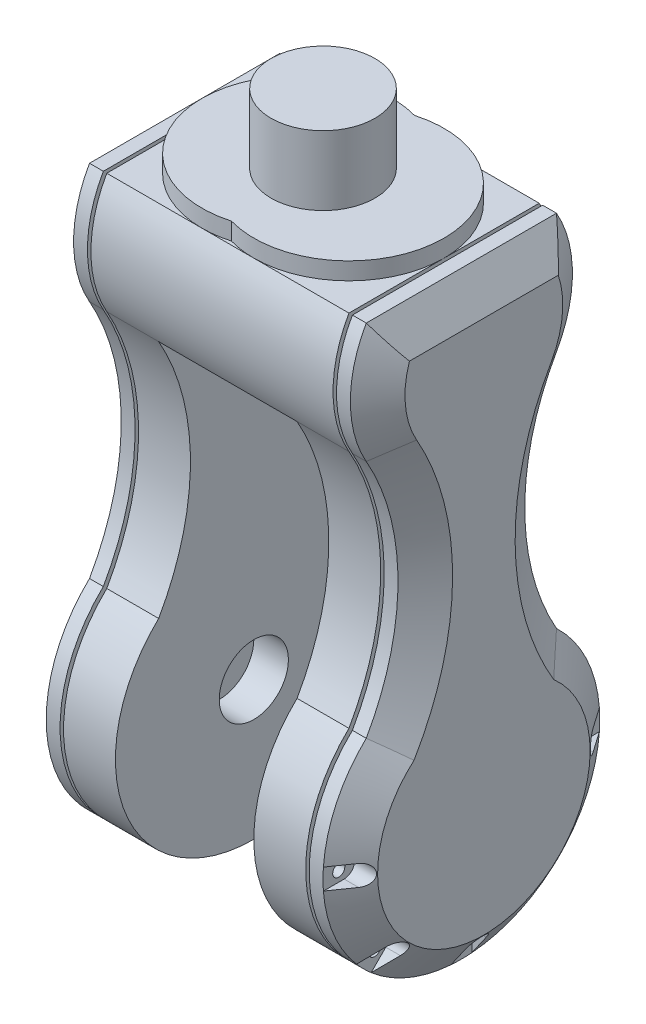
from build123d import *

# Parameters (mm, degrees)
SKETCH1_R                       = 27.5
BOSS_EXTRUDE1_DEPTH             = 5
BOSS_EXTRUDE2_DEPTH             = 15
BOSS_EXTRUDE4_DEPTH             = 1
BOSS_EXTRUDE6_DEPTH             = 4
BOSS_EXTRUDE7_DEPTH             = 6.5
BOSS_EXTRUDE7_DRAFT             = 55
CUT_EXTRUDE1_DEPTH              = 6.5
SKETCH14_R                      = 1.75
CUT_EXTRUDE2_DEPTH              = 5
CIRPATTERN2_COUNT               = 3
CIRPATTERN2_ANGLE               = 90
CIRPATTERN2_THE_OTHER_WAY_COUNT = 3
CIRPATTERN2_THE_OTHER_WAY_ANGLE = 90
BOSS_EXTRUDE8_DEPTH             = 40
SKETCH19_R                      = 15
BOSS_EXTRUDE9_DEPTH             = 20
SKETCH21_R                      = 10
CUT_EXTRUDE3_DEPTH              = 10


with BuildPart() as part:
    # Sketch1 → Boss-Extrude1 (new body)
    with BuildSketch(Plane(origin=(0, 0, 0), x_dir=(1, 0, 0), z_dir=(0, 1, 0))):
        with Locations(Location((0, 0, 0), (0, 0, 270))):
            Circle(SKETCH1_R)
    extrude(amount=BOSS_EXTRUDE1_DEPTH)



with BuildPart() as body_2:
    # Sketch5 → Boss-Extrude2 (new body)
    with BuildSketch(Plane(origin=(27.5, 0, 0), x_dir=(0, 0, -1), z_dir=(1, 0, 0))):
        with BuildLine():
            Line((-27.5, 0), (27.5, 0))
            ThreePointArc((27.5, 0), (32.08899515, -17.325437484), (27.5, -34.650874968))
            ThreePointArc((27.5, -34.650874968), (18.3220097, -69.301749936), (27.5, -103.952624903))
            ThreePointArc((27.5, -103.952624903), (0, -173), (-27.5, -103.952624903))
            ThreePointArc((-27.5, -103.952624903), (-18.3220097, -69.301749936), (-27.5, -34.650874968))
            ThreePointArc((-27.5, -34.650874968), (-32.08899515, -17.325437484), (-27.5, 0))
        make_face()
    extrude(amount=BOSS_EXTRUDE2_DEPTH)

    # Sketch10 → Boss-Extrude4 (add)
    with BuildSketch(Plane(origin=(42.5, 0, 0), x_dir=(0, 0, -1), z_dir=(1, 0, 0))):
        with BuildLine():
            Line((26.010551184, -2.5), (-26.010551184, -2.5))
            ThreePointArc((-26.010551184, -2.5), (-29.58107112, -18.04307188), (-25.327785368, -33.413343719))
            ThreePointArc((-25.327785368, -33.413343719), (-15.822259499, -69.492067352), (-25.517071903, -105.520388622))
            ThreePointArc((-25.517071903, -105.520388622), (0, -170.5), (25.517071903, -105.520388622))
            ThreePointArc((25.517071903, -105.520388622), (15.822259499, -69.492067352), (25.327785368, -33.413343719))
            ThreePointArc((25.327785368, -33.413343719), (29.58107112, -18.04307188), (26.010551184, -2.5))
        make_face()
    extrude(amount=BOSS_EXTRUDE4_DEPTH)

    # Sketch11 → Boss-Extrude6 (add)
    with BuildSketch(Plane(origin=(43.5, 0, 0), x_dir=(0, 0, -1), z_dir=(1, 0, 0))):
        with BuildLine():
            Line((27.5, 0), (-27.5, 0))
            ThreePointArc((-27.5, 0), (-32.08899515, -17.325437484), (-27.5, -34.650874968))
            ThreePointArc((-27.5, -34.650874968), (-18.3220097, -69.301749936), (-27.5, -103.952624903))
            ThreePointArc((-27.5, -103.952624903), (0, -173), (27.5, -103.952624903))
            ThreePointArc((27.5, -103.952624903), (18.3220097, -69.301749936), (27.5, -34.650874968))
            ThreePointArc((27.5, -34.650874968), (32.08899515, -17.325437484), (27.5, 0))
        make_face()
    extrude(amount=BOSS_EXTRUDE6_DEPTH)


with BuildPart() as boss_extrude7_tool:
    # Sketch12 → Boss-Extrude7 (with draft: the straight prism first)
    with BuildSketch(Plane(origin=(47.5, 0, 0), x_dir=(0, 0, -1), z_dir=(1, 0, 0))):
        with BuildLine():
            Line((27.5, 0), (-27.5, 0))
            ThreePointArc((-27.5, 0), (-32.08899515, -17.325437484), (-27.5, -34.650874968))
            ThreePointArc((-27.5, -34.650874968), (-18.3220097, -69.301749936), (-27.5, -103.952624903))
            ThreePointArc((-27.5, -103.952624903), (0, -173), (27.5, -103.952624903))
            ThreePointArc((27.5, -103.952624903), (18.3220097, -69.301749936), (27.5, -34.650874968))
            ThreePointArc((27.5, -34.650874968), (32.08899515, -17.325437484), (27.5, 0))
        make_face()
    extrude(amount=BOSS_EXTRUDE7_DEPTH)
    # Boss-Extrude7: the draft: its side faces are tilted about the plane it starts from
    boss_extrude7_sides = [boss_extrude7_tool.faces().sort_by_distance(p)[0] for p in [
        (50.75, -17.325437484, -32.08899515),
        (50.75, 0, 0),
        (50.75, -17.325437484, 32.08899515),
        (50.75, -69.301749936, 18.3220097),
        (50.75, -173, 0),
        (50.75, -69.301749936, -18.3220097),
    ]]
    draft(boss_extrude7_sides, Plane(origin=(47.5, 0, 0), x_dir=(0, 0, -1), z_dir=(1, 0, 0)), BOSS_EXTRUDE7_DRAFT)


with BuildPart() as body_2_1:
    add(body_2.part)

    # Boss-Extrude7: add boss_extrude7_tool
    add(boss_extrude7_tool.part)

    # Sketch13 → Cut-Extrude1 (cut)
    with BuildSketch(Plane(origin=(54, 0, 0), x_dir=(0, 0, -1), z_dir=(1, 0, 0))):
        with BuildLine():
            Line((3, -172.88734135), (3, -166.88734135))
            ThreePointArc((3, -166.88734135), (0, -163.88734135), (-3, -166.88734135))
            Line((-3, -166.88734135), (-3, -172.88734135))
            ThreePointArc((-3, -172.88734135), (0, -173.88734135), (3, -172.88734135))
        make_face()
    cut_extrude1 = extrude(amount=-CUT_EXTRUDE1_DEPTH, mode=Mode.SUBTRACT)

    # Sketch14 → Cut-Extrude2 (cut)
    with BuildSketch(Plane(origin=(47.5, 0, 0), x_dir=(0, 0, -1), z_dir=(1, 0, 0))):
        with Locations((0, -168.443670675)):
            Circle(SKETCH14_R)
    cut_extrude2 = extrude(amount=-CUT_EXTRUDE2_DEPTH, mode=Mode.SUBTRACT)

    # CirPattern2: Cut-Extrude1, Cut-Extrude2 ×3 about axis
    cirpattern2_axis = Axis((0, -133, 0), (1, 0, 0))
    add([cut_extrude1.rotate(cirpattern2_axis, i * CIRPATTERN2_ANGLE / (CIRPATTERN2_COUNT - 1)) for i in range(1, CIRPATTERN2_COUNT)], mode=Mode.SUBTRACT)
    add([cut_extrude2.rotate(cirpattern2_axis, i * CIRPATTERN2_ANGLE / (CIRPATTERN2_COUNT - 1)) for i in range(1, CIRPATTERN2_COUNT)], mode=Mode.SUBTRACT)

    # CirPattern2 the other way: Cut-Extrude1, Cut-Extrude2 ×3 about axis
    cirpattern2_the_other_way_axis = Axis((0, -133, 0), (-1, 0, 0))
    add([cut_extrude1.rotate(cirpattern2_the_other_way_axis, i * CIRPATTERN2_THE_OTHER_WAY_ANGLE / (CIRPATTERN2_THE_OTHER_WAY_COUNT - 1)) for i in range(1, CIRPATTERN2_THE_OTHER_WAY_COUNT)], mode=Mode.SUBTRACT)
    add([cut_extrude2.rotate(cirpattern2_the_other_way_axis, i * CIRPATTERN2_THE_OTHER_WAY_ANGLE / (CIRPATTERN2_THE_OTHER_WAY_COUNT - 1)) for i in range(1, CIRPATTERN2_THE_OTHER_WAY_COUNT)], mode=Mode.SUBTRACT)


with BuildPart() as part_1:
    add(part.part)

    add(body_2_1.part)  # Boss-Extrude8 merges body 2
    # Sketch15 → Boss-Extrude8 (add)
    with BuildSketch(Plane.ZY.offset(-27.5)):
        with BuildLine():
            Line((-27.5, -34.650874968), (27.5, -34.650874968))
            ThreePointArc((27.5, -34.650874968), (32.08899515, -17.325437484), (27.5, 0))
            Line((27.5, 0), (-27.5, 0))
            ThreePointArc((-27.5, 0), (-32.08899515, -17.325437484), (-27.5, -34.650874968))
        make_face()
    extrude(amount=BOSS_EXTRUDE8_DEPTH)

    # Mirror1: part across plane


with BuildPart() as part_2:
    add(part_1.part)
    add(part_1.part.mirror(Plane.ZY.offset(-7.5)))

    # Sketch19 → Boss-Extrude9 (add)
    with BuildSketch(Plane(origin=(0, 5, 0), x_dir=(1, 0, 0), z_dir=(0, 1, 0))):
        with Locations(Location((7.5, 0, 0), (0, 0, 270))):
            Circle(SKETCH19_R)
    extrude(amount=BOSS_EXTRUDE9_DEPTH)

    # Sketch21 → Cut-Extrude3 (cut)
    with BuildSketch(Plane(origin=(-12.5, 0, 0), x_dir=(0, 0, -1), z_dir=(1, 0, 0))):
        with Locations((0, -133)):
            Circle(SKETCH21_R)
    cut_extrude3 = extrude(amount=-CUT_EXTRUDE3_DEPTH, mode=Mode.SUBTRACT)

    # Mirror2: Cut-Extrude3 across plane
    add(cut_extrude3.mirror(Plane.ZY.offset(-7.5)), mode=Mode.SUBTRACT)


solid = part_2.part
